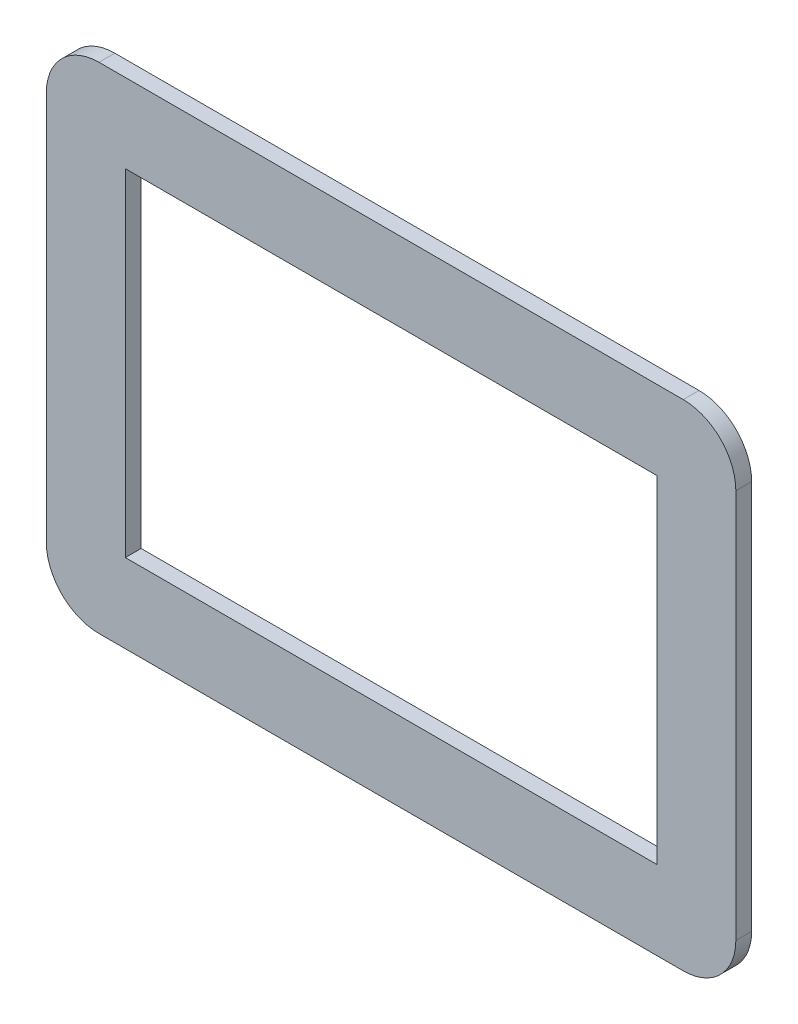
ISO-10303-21;
HEADER;
FILE_DESCRIPTION(('STEP AP214'),'2;1');
FILE_NAME('part.step','',(''),(''),'','','');
FILE_SCHEMA(('AUTOMOTIVE_DESIGN { 1 0 10303 214 1 1 1 1 }'));
ENDSEC;
DATA;
#1=APPLICATION_CONTEXT('core data for automotive mechanical design processes');
#2=APPLICATION_PROTOCOL_DEFINITION('international standard','automotive_design',2000,#1);
#3=PRODUCT_CONTEXT('',#1,'mechanical');
#4=PRODUCT('Part','Part','',(#3));
#5=PRODUCT_RELATED_PRODUCT_CATEGORY('part','',(#4));
#6=PRODUCT_DEFINITION_FORMATION('','',#4);
#7=PRODUCT_DEFINITION_CONTEXT('part definition',#1,'design');
#8=PRODUCT_DEFINITION('design','',#6,#7);
#9=PRODUCT_DEFINITION_SHAPE('','',#8);
#10=(LENGTH_UNIT() NAMED_UNIT(*) SI_UNIT(.MILLI.,.METRE.));
#11=(NAMED_UNIT(*) PLANE_ANGLE_UNIT() SI_UNIT($,.RADIAN.));
#12=(NAMED_UNIT(*) SI_UNIT($,.STERADIAN.) SOLID_ANGLE_UNIT());
#13=UNCERTAINTY_MEASURE_WITH_UNIT(LENGTH_MEASURE(1.E-05),#10,'distance_accuracy_value','');
#14=(GEOMETRIC_REPRESENTATION_CONTEXT(3) GLOBAL_UNCERTAINTY_ASSIGNED_CONTEXT((#13)) GLOBAL_UNIT_ASSIGNED_CONTEXT((#10,
#11,#12)) REPRESENTATION_CONTEXT('',''));
#15=CARTESIAN_POINT('',(0.,0.,0.));
#16=DIRECTION('',(0.,0.,1.));
#17=DIRECTION('',(1.,0.,0.));
#18=AXIS2_PLACEMENT_3D('',#15,#16,#17);
#19=CARTESIAN_POINT('',(-111.,74.,6.));
#20=DIRECTION('',(0.,0.,1.));
#21=DIRECTION('',(1.,0.,0.));
#22=AXIS2_PLACEMENT_3D('',#19,#20,#21);
#23=PLANE('',#22);
#24=CARTESIAN_POINT('',(-111.,74.,6.));
#25=DIRECTION('',(0.,0.,1.));
#26=DIRECTION('',(1.,0.,0.));
#27=AXIS2_PLACEMENT_3D('',#24,#25,#26);
#28=CIRCLE('',#27,20.);
#29=CARTESIAN_POINT('',(-111.,94.,6.));
#30=VERTEX_POINT('',#29);
#31=CARTESIAN_POINT('',(-131.,73.9999999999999,6.));
#32=VERTEX_POINT('',#31);
#33=EDGE_CURVE('E244',#30,#32,#28,.T.);
#34=ORIENTED_EDGE('',*,*,#33,.T.);
#35=DIRECTION('',(0.,-1.,0.));
#36=VECTOR('',#35,1.);
#37=CARTESIAN_POINT('',(-131.,73.9999999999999,6.));
#38=LINE('',#37,#36);
#39=CARTESIAN_POINT('',(-131.,-73.9999999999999,6.));
#40=VERTEX_POINT('',#39);
#41=EDGE_CURVE('E247',#32,#40,#38,.T.);
#42=ORIENTED_EDGE('',*,*,#41,.T.);
#43=CARTESIAN_POINT('',(-111.,-74.,6.));
#44=DIRECTION('',(0.,0.,1.));
#45=DIRECTION('',(1.,0.,0.));
#46=AXIS2_PLACEMENT_3D('',#43,#44,#45);
#47=CIRCLE('',#46,20.);
#48=CARTESIAN_POINT('',(-111.,-94.,6.));
#49=VERTEX_POINT('',#48);
#50=EDGE_CURVE('E249',#40,#49,#47,.T.);
#51=ORIENTED_EDGE('',*,*,#50,.T.);
#52=DIRECTION('',(1.,0.,0.));
#53=VECTOR('',#52,1.);
#54=CARTESIAN_POINT('',(-111.,-94.,6.));
#55=LINE('',#54,#53);
#56=CARTESIAN_POINT('',(111.,-94.,6.));
#57=VERTEX_POINT('',#56);
#58=EDGE_CURVE('E251',#49,#57,#55,.T.);
#59=ORIENTED_EDGE('',*,*,#58,.T.);
#60=CARTESIAN_POINT('',(111.,-74.,6.));
#61=DIRECTION('',(0.,0.,1.));
#62=DIRECTION('',(1.,0.,0.));
#63=AXIS2_PLACEMENT_3D('',#60,#61,#62);
#64=CIRCLE('',#63,20.);
#65=CARTESIAN_POINT('',(131.,-73.9999999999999,6.));
#66=VERTEX_POINT('',#65);
#67=EDGE_CURVE('E253',#57,#66,#64,.T.);
#68=ORIENTED_EDGE('',*,*,#67,.T.);
#69=DIRECTION('',(0.,1.,0.));
#70=VECTOR('',#69,1.);
#71=CARTESIAN_POINT('',(131.,73.9999999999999,6.));
#72=LINE('',#71,#70);
#73=CARTESIAN_POINT('',(131.,73.9999999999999,6.));
#74=VERTEX_POINT('',#73);
#75=EDGE_CURVE('E255',#66,#74,#72,.T.);
#76=ORIENTED_EDGE('',*,*,#75,.T.);
#77=CARTESIAN_POINT('',(111.,74.,6.));
#78=DIRECTION('',(0.,0.,1.));
#79=DIRECTION('',(-1.,0.,0.));
#80=AXIS2_PLACEMENT_3D('',#77,#78,#79);
#81=CIRCLE('',#80,20.);
#82=CARTESIAN_POINT('',(111.,94.,6.));
#83=VERTEX_POINT('',#82);
#84=EDGE_CURVE('E257',#74,#83,#81,.T.);
#85=ORIENTED_EDGE('',*,*,#84,.T.);
#86=DIRECTION('',(-1.,0.,0.));
#87=VECTOR('',#86,1.);
#88=CARTESIAN_POINT('',(-111.,94.,6.));
#89=LINE('',#88,#87);
#90=EDGE_CURVE('E259',#83,#30,#89,.T.);
#91=ORIENTED_EDGE('',*,*,#90,.T.);
#92=EDGE_LOOP('',(#34,#42,#51,#59,#68,#76,#85,#91));
#93=FACE_BOUND('',#92,.T.);
#94=DIRECTION('',(1.,0.,0.));
#95=VECTOR('',#94,1.);
#96=CARTESIAN_POINT('',(-111.,-64.,6.));
#97=LINE('',#96,#95);
#98=CARTESIAN_POINT('',(-101.,-64.,6.));
#99=VERTEX_POINT('',#98);
#100=CARTESIAN_POINT('',(101.,-64.,6.));
#101=VERTEX_POINT('',#100);
#102=EDGE_CURVE('E218',#99,#101,#97,.T.);
#103=ORIENTED_EDGE('',*,*,#102,.F.);
#104=DIRECTION('',(0.,-1.,0.));
#105=VECTOR('',#104,1.);
#106=CARTESIAN_POINT('',(-101.,73.9999999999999,6.));
#107=LINE('',#106,#105);
#108=CARTESIAN_POINT('',(-101.,64.,6.));
#109=VERTEX_POINT('',#108);
#110=EDGE_CURVE('E207',#109,#99,#107,.T.);
#111=ORIENTED_EDGE('',*,*,#110,.F.);
#112=DIRECTION('',(-1.,0.,0.));
#113=VECTOR('',#112,1.);
#114=CARTESIAN_POINT('',(-111.,64.,6.));
#115=LINE('',#114,#113);
#116=CARTESIAN_POINT('',(101.,64.,6.));
#117=VERTEX_POINT('',#116);
#118=EDGE_CURVE('E222',#117,#109,#115,.T.);
#119=ORIENTED_EDGE('',*,*,#118,.F.);
#120=DIRECTION('',(0.,1.,0.));
#121=VECTOR('',#120,1.);
#122=CARTESIAN_POINT('',(101.,73.9999999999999,6.));
#123=LINE('',#122,#121);
#124=EDGE_CURVE('E220',#101,#117,#123,.T.);
#125=ORIENTED_EDGE('',*,*,#124,.F.);
#126=EDGE_LOOP('',(#103,#111,#119,#125));
#127=FACE_BOUND('',#126,.T.);
#128=ADVANCED_FACE('F103',(#93,#127),#23,.T.);
#129=CARTESIAN_POINT('',(-111.,74.,0.));
#130=DIRECTION('',(0.,0.,1.));
#131=DIRECTION('',(1.,0.,0.));
#132=AXIS2_PLACEMENT_3D('',#129,#130,#131);
#133=PLANE('',#132);
#134=CARTESIAN_POINT('',(-111.,74.,0.));
#135=DIRECTION('',(0.,0.,1.));
#136=DIRECTION('',(1.,0.,0.));
#137=AXIS2_PLACEMENT_3D('',#134,#135,#136);
#138=CIRCLE('',#137,20.);
#139=CARTESIAN_POINT('',(-111.,94.,0.));
#140=VERTEX_POINT('',#139);
#141=CARTESIAN_POINT('',(-131.,73.9999999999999,0.));
#142=VERTEX_POINT('',#141);
#143=EDGE_CURVE('E208',#140,#142,#138,.T.);
#144=ORIENTED_EDGE('',*,*,#143,.F.);
#145=DIRECTION('',(-1.,0.,0.));
#146=VECTOR('',#145,1.);
#147=CARTESIAN_POINT('',(-111.,94.,0.));
#148=LINE('',#147,#146);
#149=CARTESIAN_POINT('',(111.,94.,0.));
#150=VERTEX_POINT('',#149);
#151=EDGE_CURVE('E242',#150,#140,#148,.T.);
#152=ORIENTED_EDGE('',*,*,#151,.F.);
#153=CARTESIAN_POINT('',(111.,74.,0.));
#154=DIRECTION('',(0.,0.,1.));
#155=DIRECTION('',(-1.,0.,0.));
#156=AXIS2_PLACEMENT_3D('',#153,#154,#155);
#157=CIRCLE('',#156,20.);
#158=CARTESIAN_POINT('',(131.,73.9999999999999,0.));
#159=VERTEX_POINT('',#158);
#160=EDGE_CURVE('E240',#159,#150,#157,.T.);
#161=ORIENTED_EDGE('',*,*,#160,.F.);
#162=DIRECTION('',(0.,1.,0.));
#163=VECTOR('',#162,1.);
#164=CARTESIAN_POINT('',(131.,73.9999999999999,0.));
#165=LINE('',#164,#163);
#166=CARTESIAN_POINT('',(131.,-73.9999999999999,0.));
#167=VERTEX_POINT('',#166);
#168=EDGE_CURVE('E238',#167,#159,#165,.T.);
#169=ORIENTED_EDGE('',*,*,#168,.F.);
#170=CARTESIAN_POINT('',(111.,-74.,0.));
#171=DIRECTION('',(0.,0.,1.));
#172=DIRECTION('',(1.,0.,0.));
#173=AXIS2_PLACEMENT_3D('',#170,#171,#172);
#174=CIRCLE('',#173,20.);
#175=CARTESIAN_POINT('',(111.,-94.,0.));
#176=VERTEX_POINT('',#175);
#177=EDGE_CURVE('E236',#176,#167,#174,.T.);
#178=ORIENTED_EDGE('',*,*,#177,.F.);
#179=DIRECTION('',(1.,0.,0.));
#180=VECTOR('',#179,1.);
#181=CARTESIAN_POINT('',(-111.,-94.,0.));
#182=LINE('',#181,#180);
#183=CARTESIAN_POINT('',(-111.,-94.,0.));
#184=VERTEX_POINT('',#183);
#185=EDGE_CURVE('E234',#184,#176,#182,.T.);
#186=ORIENTED_EDGE('',*,*,#185,.F.);
#187=CARTESIAN_POINT('',(-111.,-74.,0.));
#188=DIRECTION('',(0.,0.,1.));
#189=DIRECTION('',(1.,0.,0.));
#190=AXIS2_PLACEMENT_3D('',#187,#188,#189);
#191=CIRCLE('',#190,20.);
#192=CARTESIAN_POINT('',(-131.,-73.9999999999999,0.));
#193=VERTEX_POINT('',#192);
#194=EDGE_CURVE('E232',#193,#184,#191,.T.);
#195=ORIENTED_EDGE('',*,*,#194,.F.);
#196=DIRECTION('',(0.,-1.,0.));
#197=VECTOR('',#196,1.);
#198=CARTESIAN_POINT('',(-131.,73.9999999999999,0.));
#199=LINE('',#198,#197);
#200=EDGE_CURVE('E230',#142,#193,#199,.T.);
#201=ORIENTED_EDGE('',*,*,#200,.F.);
#202=EDGE_LOOP('',(#144,#152,#161,#169,#178,#186,#195,#201));
#203=FACE_BOUND('',#202,.T.);
#204=DIRECTION('',(0.,-1.,0.));
#205=VECTOR('',#204,1.);
#206=CARTESIAN_POINT('',(-101.,73.9999999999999,0.));
#207=LINE('',#206,#205);
#208=CARTESIAN_POINT('',(-101.,64.,0.));
#209=VERTEX_POINT('',#208);
#210=CARTESIAN_POINT('',(-101.,-64.,0.));
#211=VERTEX_POINT('',#210);
#212=EDGE_CURVE('E126',#209,#211,#207,.T.);
#213=ORIENTED_EDGE('',*,*,#212,.T.);
#214=DIRECTION('',(1.,0.,0.));
#215=VECTOR('',#214,1.);
#216=CARTESIAN_POINT('',(-111.,-64.,0.));
#217=LINE('',#216,#215);
#218=CARTESIAN_POINT('',(101.,-64.,0.));
#219=VERTEX_POINT('',#218);
#220=EDGE_CURVE('E194',#211,#219,#217,.T.);
#221=ORIENTED_EDGE('',*,*,#220,.T.);
#222=DIRECTION('',(0.,1.,0.));
#223=VECTOR('',#222,1.);
#224=CARTESIAN_POINT('',(101.,73.9999999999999,0.));
#225=LINE('',#224,#223);
#226=CARTESIAN_POINT('',(101.,64.,0.));
#227=VERTEX_POINT('',#226);
#228=EDGE_CURVE('E203',#219,#227,#225,.T.);
#229=ORIENTED_EDGE('',*,*,#228,.T.);
#230=DIRECTION('',(-1.,0.,0.));
#231=VECTOR('',#230,1.);
#232=CARTESIAN_POINT('',(-111.,64.,0.));
#233=LINE('',#232,#231);
#234=EDGE_CURVE('E212',#227,#209,#233,.T.);
#235=ORIENTED_EDGE('',*,*,#234,.T.);
#236=EDGE_LOOP('',(#213,#221,#229,#235));
#237=FACE_BOUND('',#236,.T.);
#238=ADVANCED_FACE('F211',(#203,#237),#133,.F.);
#239=CARTESIAN_POINT('',(-111.,74.,6.));
#240=DIRECTION('',(0.,0.,-1.));
#241=DIRECTION('',(-1.,0.,0.));
#242=AXIS2_PLACEMENT_3D('',#239,#240,#241);
#243=CYLINDRICAL_SURFACE('',#242,20.);
#244=ORIENTED_EDGE('',*,*,#143,.T.);
#245=DIRECTION('',(0.,0.,-1.));
#246=VECTOR('',#245,1.);
#247=CARTESIAN_POINT('',(-131.,73.9999999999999,6.));
#248=LINE('',#247,#246);
#249=EDGE_CURVE('E12',#32,#142,#248,.T.);
#250=ORIENTED_EDGE('',*,*,#249,.F.);
#251=ORIENTED_EDGE('',*,*,#33,.F.);
#252=DIRECTION('',(0.,0.,-1.));
#253=VECTOR('',#252,1.);
#254=CARTESIAN_POINT('',(-111.,94.,6.));
#255=LINE('',#254,#253);
#256=EDGE_CURVE('E261',#30,#140,#255,.T.);
#257=ORIENTED_EDGE('',*,*,#256,.T.);
#258=EDGE_LOOP('',(#244,#250,#251,#257));
#259=FACE_BOUND('',#258,.T.);
#260=ADVANCED_FACE('F105',(#259),#243,.T.);
#261=CARTESIAN_POINT('',(-131.,73.9999999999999,6.));
#262=DIRECTION('',(1.,0.,0.));
#263=DIRECTION('',(0.,1.,0.));
#264=AXIS2_PLACEMENT_3D('',#261,#262,#263);
#265=PLANE('',#264);
#266=ORIENTED_EDGE('',*,*,#200,.T.);
#267=DIRECTION('',(0.,0.,-1.));
#268=VECTOR('',#267,1.);
#269=CARTESIAN_POINT('',(-131.,-73.9999999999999,6.));
#270=LINE('',#269,#268);
#271=EDGE_CURVE('E111',#40,#193,#270,.T.);
#272=ORIENTED_EDGE('',*,*,#271,.F.);
#273=ORIENTED_EDGE('',*,*,#41,.F.);
#274=ORIENTED_EDGE('',*,*,#249,.T.);
#275=EDGE_LOOP('',(#266,#272,#273,#274));
#276=FACE_BOUND('',#275,.T.);
#277=ADVANCED_FACE('F305',(#276),#265,.F.);
#278=CARTESIAN_POINT('',(-111.,-74.,6.));
#279=DIRECTION('',(0.,0.,-1.));
#280=DIRECTION('',(-1.,0.,0.));
#281=AXIS2_PLACEMENT_3D('',#278,#279,#280);
#282=CYLINDRICAL_SURFACE('',#281,20.);
#283=ORIENTED_EDGE('',*,*,#194,.T.);
#284=DIRECTION('',(0.,0.,-1.));
#285=VECTOR('',#284,1.);
#286=CARTESIAN_POINT('',(-111.,-94.,6.));
#287=LINE('',#286,#285);
#288=EDGE_CURVE('E276',#49,#184,#287,.T.);
#289=ORIENTED_EDGE('',*,*,#288,.F.);
#290=ORIENTED_EDGE('',*,*,#50,.F.);
#291=ORIENTED_EDGE('',*,*,#271,.T.);
#292=EDGE_LOOP('',(#283,#289,#290,#291));
#293=FACE_BOUND('',#292,.T.);
#294=ADVANCED_FACE('F283',(#293),#282,.T.);
#295=CARTESIAN_POINT('',(-111.,-94.,6.));
#296=DIRECTION('',(0.,1.,0.));
#297=DIRECTION('',(0.,0.,1.));
#298=AXIS2_PLACEMENT_3D('',#295,#296,#297);
#299=PLANE('',#298);
#300=ORIENTED_EDGE('',*,*,#185,.T.);
#301=DIRECTION('',(0.,0.,-1.));
#302=VECTOR('',#301,1.);
#303=CARTESIAN_POINT('',(111.,-94.,6.));
#304=LINE('',#303,#302);
#305=EDGE_CURVE('E273',#57,#176,#304,.T.);
#306=ORIENTED_EDGE('',*,*,#305,.F.);
#307=ORIENTED_EDGE('',*,*,#58,.F.);
#308=ORIENTED_EDGE('',*,*,#288,.T.);
#309=EDGE_LOOP('',(#300,#306,#307,#308));
#310=FACE_BOUND('',#309,.T.);
#311=ADVANCED_FACE('F293',(#310),#299,.F.);
#312=CARTESIAN_POINT('',(111.,-74.,6.));
#313=DIRECTION('',(0.,0.,-1.));
#314=DIRECTION('',(-1.,0.,0.));
#315=AXIS2_PLACEMENT_3D('',#312,#313,#314);
#316=CYLINDRICAL_SURFACE('',#315,20.);
#317=ORIENTED_EDGE('',*,*,#177,.T.);
#318=DIRECTION('',(0.,0.,-1.));
#319=VECTOR('',#318,1.);
#320=CARTESIAN_POINT('',(131.,-73.9999999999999,6.));
#321=LINE('',#320,#319);
#322=EDGE_CURVE('E270',#66,#167,#321,.T.);
#323=ORIENTED_EDGE('',*,*,#322,.F.);
#324=ORIENTED_EDGE('',*,*,#67,.F.);
#325=ORIENTED_EDGE('',*,*,#305,.T.);
#326=EDGE_LOOP('',(#317,#323,#324,#325));
#327=FACE_BOUND('',#326,.T.);
#328=ADVANCED_FACE('F297',(#327),#316,.T.);
#329=CARTESIAN_POINT('',(131.,73.9999999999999,6.));
#330=DIRECTION('',(-1.,0.,0.));
#331=DIRECTION('',(0.,-1.,0.));
#332=AXIS2_PLACEMENT_3D('',#329,#330,#331);
#333=PLANE('',#332);
#334=ORIENTED_EDGE('',*,*,#168,.T.);
#335=DIRECTION('',(0.,0.,-1.));
#336=VECTOR('',#335,1.);
#337=CARTESIAN_POINT('',(131.,73.9999999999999,6.));
#338=LINE('',#337,#336);
#339=EDGE_CURVE('E267',#74,#159,#338,.T.);
#340=ORIENTED_EDGE('',*,*,#339,.F.);
#341=ORIENTED_EDGE('',*,*,#75,.F.);
#342=ORIENTED_EDGE('',*,*,#322,.T.);
#343=EDGE_LOOP('',(#334,#340,#341,#342));
#344=FACE_BOUND('',#343,.T.);
#345=ADVANCED_FACE('F318',(#344),#333,.F.);
#346=CARTESIAN_POINT('',(111.,74.,6.));
#347=DIRECTION('',(0.,0.,-1.));
#348=DIRECTION('',(-1.,0.,0.));
#349=AXIS2_PLACEMENT_3D('',#346,#347,#348);
#350=CYLINDRICAL_SURFACE('',#349,20.);
#351=ORIENTED_EDGE('',*,*,#160,.T.);
#352=DIRECTION('',(0.,0.,-1.));
#353=VECTOR('',#352,1.);
#354=CARTESIAN_POINT('',(111.,94.,6.));
#355=LINE('',#354,#353);
#356=EDGE_CURVE('E264',#83,#150,#355,.T.);
#357=ORIENTED_EDGE('',*,*,#356,.F.);
#358=ORIENTED_EDGE('',*,*,#84,.F.);
#359=ORIENTED_EDGE('',*,*,#339,.T.);
#360=EDGE_LOOP('',(#351,#357,#358,#359));
#361=FACE_BOUND('',#360,.T.);
#362=ADVANCED_FACE('F316',(#361),#350,.T.);
#363=CARTESIAN_POINT('',(-111.,94.,6.));
#364=DIRECTION('',(0.,-1.,0.));
#365=DIRECTION('',(0.,0.,-1.));
#366=AXIS2_PLACEMENT_3D('',#363,#364,#365);
#367=PLANE('',#366);
#368=ORIENTED_EDGE('',*,*,#151,.T.);
#369=ORIENTED_EDGE('',*,*,#256,.F.);
#370=ORIENTED_EDGE('',*,*,#90,.F.);
#371=ORIENTED_EDGE('',*,*,#356,.T.);
#372=EDGE_LOOP('',(#368,#369,#370,#371));
#373=FACE_BOUND('',#372,.T.);
#374=ADVANCED_FACE('F311',(#373),#367,.F.);
#375=CARTESIAN_POINT('',(-101.,73.9999999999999,6.));
#376=DIRECTION('',(1.,0.,0.));
#377=DIRECTION('',(0.,1.,0.));
#378=AXIS2_PLACEMENT_3D('',#375,#376,#377);
#379=PLANE('',#378);
#380=ORIENTED_EDGE('',*,*,#212,.F.);
#381=DIRECTION('',(0.,0.,-1.));
#382=VECTOR('',#381,1.);
#383=CARTESIAN_POINT('',(-101.,64.,6.));
#384=LINE('',#383,#382);
#385=EDGE_CURVE('E224',#109,#209,#384,.T.);
#386=ORIENTED_EDGE('',*,*,#385,.F.);
#387=ORIENTED_EDGE('',*,*,#110,.T.);
#388=DIRECTION('',(0.,0.,-1.));
#389=VECTOR('',#388,1.);
#390=CARTESIAN_POINT('',(-101.,-64.,6.));
#391=LINE('',#390,#389);
#392=EDGE_CURVE('E196',#99,#211,#391,.T.);
#393=ORIENTED_EDGE('',*,*,#392,.T.);
#394=EDGE_LOOP('',(#380,#386,#387,#393));
#395=FACE_BOUND('',#394,.T.);
#396=ADVANCED_FACE('F205',(#395),#379,.T.);
#397=CARTESIAN_POINT('',(-111.,-64.,6.));
#398=DIRECTION('',(0.,1.,0.));
#399=DIRECTION('',(0.,0.,1.));
#400=AXIS2_PLACEMENT_3D('',#397,#398,#399);
#401=PLANE('',#400);
#402=ORIENTED_EDGE('',*,*,#220,.F.);
#403=ORIENTED_EDGE('',*,*,#392,.F.);
#404=ORIENTED_EDGE('',*,*,#102,.T.);
#405=DIRECTION('',(0.,0.,-1.));
#406=VECTOR('',#405,1.);
#407=CARTESIAN_POINT('',(101.,-64.,6.));
#408=LINE('',#407,#406);
#409=EDGE_CURVE('E199',#101,#219,#408,.T.);
#410=ORIENTED_EDGE('',*,*,#409,.T.);
#411=EDGE_LOOP('',(#402,#403,#404,#410));
#412=FACE_BOUND('',#411,.T.);
#413=ADVANCED_FACE('F195',(#412),#401,.T.);
#414=CARTESIAN_POINT('',(101.,73.9999999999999,6.));
#415=DIRECTION('',(-1.,0.,0.));
#416=DIRECTION('',(0.,-1.,0.));
#417=AXIS2_PLACEMENT_3D('',#414,#415,#416);
#418=PLANE('',#417);
#419=ORIENTED_EDGE('',*,*,#228,.F.);
#420=ORIENTED_EDGE('',*,*,#409,.F.);
#421=ORIENTED_EDGE('',*,*,#124,.T.);
#422=DIRECTION('',(0.,0.,-1.));
#423=VECTOR('',#422,1.);
#424=CARTESIAN_POINT('',(101.,64.,6.));
#425=LINE('',#424,#423);
#426=EDGE_CURVE('E118',#117,#227,#425,.T.);
#427=ORIENTED_EDGE('',*,*,#426,.T.);
#428=EDGE_LOOP('',(#419,#420,#421,#427));
#429=FACE_BOUND('',#428,.T.);
#430=ADVANCED_FACE('F342',(#429),#418,.T.);
#431=CARTESIAN_POINT('',(-111.,64.,6.));
#432=DIRECTION('',(0.,-1.,0.));
#433=DIRECTION('',(0.,0.,-1.));
#434=AXIS2_PLACEMENT_3D('',#431,#432,#433);
#435=PLANE('',#434);
#436=ORIENTED_EDGE('',*,*,#234,.F.);
#437=ORIENTED_EDGE('',*,*,#426,.F.);
#438=ORIENTED_EDGE('',*,*,#118,.T.);
#439=ORIENTED_EDGE('',*,*,#385,.T.);
#440=EDGE_LOOP('',(#436,#437,#438,#439));
#441=FACE_BOUND('',#440,.T.);
#442=ADVANCED_FACE('F347',(#441),#435,.T.);
#443=CLOSED_SHELL('',(#128,#238,#260,#277,#294,#311,#328,#345,#362,#374,#396,#413,#430,#442));
#444=MANIFOLD_SOLID_BREP('B2',#443);
#445=ADVANCED_BREP_SHAPE_REPRESENTATION('',(#18,#444),#14);
#446=SHAPE_DEFINITION_REPRESENTATION(#9,#445);
ENDSEC;
END-ISO-10303-21;
